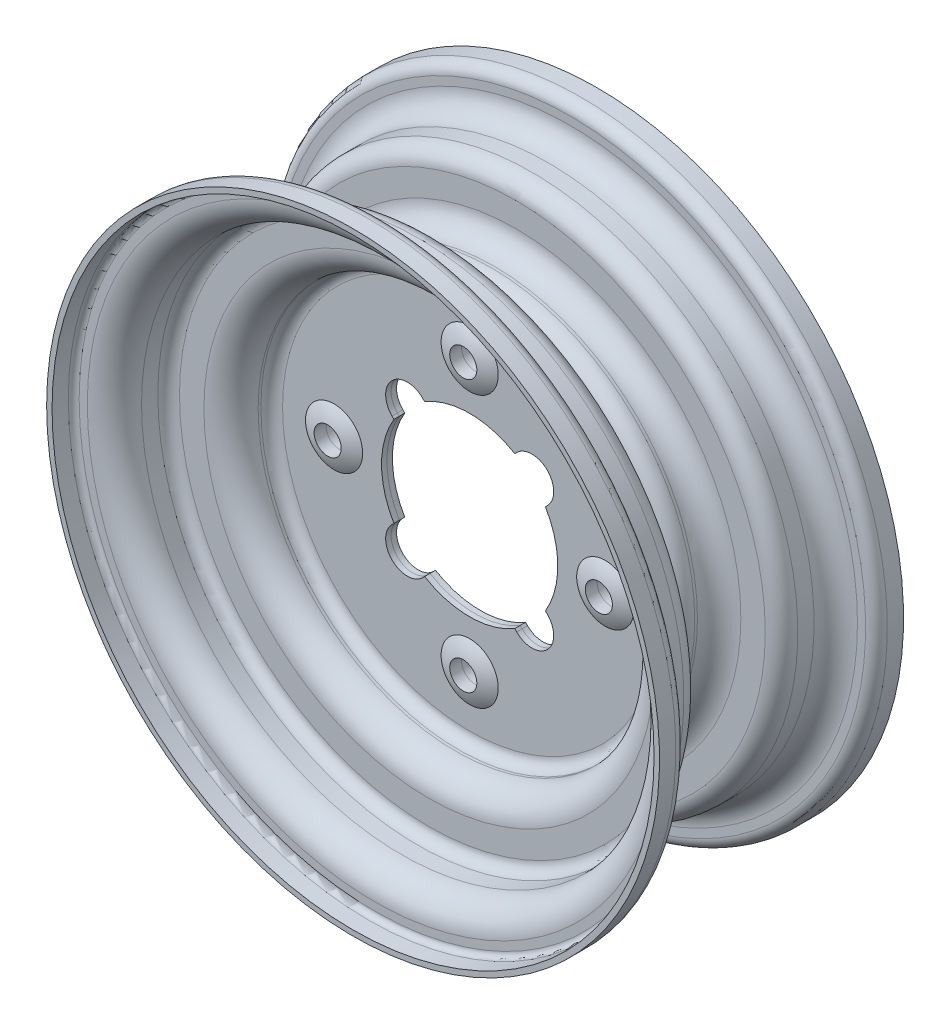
from build123d import *

# Parameters (mm, degrees)
SKETCH2_R          = 32.5
CUT_EXTRUDE1_DEPTH = 166.490181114
SKETCH4_R          = 5
CUT_EXTRUDE2_DEPTH = 166.490181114
CIRPATTERN1_COUNT  = 4


with BuildPart() as part:
    # Sketch1 → Revolve-Thin1 (revolve)
    with BuildSketch(Plane(origin=(0, 0, 0), x_dir=(0, 0, -1), z_dir=(1, 0, 0)), mode=Mode.PRIVATE) as revolve_thin1_sk:
        with BuildLine():
            Line((0, 0), (0, 69))
            ThreePointArc((0, 69), (-1.757359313, 73.242640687), (-6, 75))
            Line((-6, 75), (-7, 75))
            ThreePointArc((-7, 75), (-12.656854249, 77.343145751), (-15, 83))
            Line((-15, 83), (-15, 92))
            ThreePointArc((-15, 92), (-16.757359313, 96.242640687), (-21, 98))
            Line((-21, 98), (-27, 98))
            ThreePointArc((-27, 98), (-32.656854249, 100.343145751), (-35, 106))
            Line((-35, 106), (-35, 109))
            ThreePointArc((-35, 109), (-36.171572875, 111.828427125), (-39, 113))
            Line((-39, 113), (-45, 113))
            Line((-45, 113), (-45, 111))
            Line((-45, 111), (-39, 111))
            ThreePointArc((-39, 111), (-37.585786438, 110.414213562), (-37, 109))
            Line((-37, 109), (-37, 106))
            ThreePointArc((-37, 106), (-34.071067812, 98.928932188), (-27, 96))
            Line((-27, 96), (-21, 96))
            ThreePointArc((-21, 96), (-18.171572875, 94.828427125), (-17, 92))
            Line((-17, 92), (-17, 83))
            ThreePointArc((-17, 83), (-14.071067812, 75.928932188), (-7, 73))
            Line((-7, 73), (-6, 73))
            ThreePointArc((-6, 73), (-3.171572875, 71.828427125), (-2, 69))
            Line((-2, 69), (-2, 0))
            Line((-2, 0), (0, 0))
        make_face()
    revolve(revolve_thin1_sk.sketch.rotate(Axis((0, 0, 0), (0, 0, 1)), 90), axis=Axis((0, 0, 0), (0, 0, 1)))

    # Sketch2 → Cut-Extrude1 (cut, through all)
    with BuildSketch(Plane.XY.offset(2)):
        Circle(SKETCH2_R)
        with BuildLine():
            Line((17.324116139, -28.637824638), (-28.637824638, 17.324116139))
            ThreePointArc((-28.637824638, 17.324116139), (-28.637824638, 28.637824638), (-17.324116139, 28.637824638))
            Line((-17.324116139, 28.637824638), (28.637824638, -17.324116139))
            ThreePointArc((28.637824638, -17.324116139), (28.637824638, -28.637824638), (17.324116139, -28.637824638))
        make_face()
        with BuildLine():
            Line((-28.637824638, -17.324116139), (17.324116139, 28.637824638))
            ThreePointArc((17.324116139, 28.637824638), (28.637824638, 28.637824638), (28.637824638, 17.324116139))
            Line((28.637824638, 17.324116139), (-17.324116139, -28.637824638))
            ThreePointArc((-17.324116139, -28.637824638), (-28.637824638, -28.637824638), (-28.637824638, -17.324116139))
        make_face()
    extrude(amount=-CUT_EXTRUDE1_DEPTH, mode=Mode.SUBTRACT)

    # Sketch3 → Revolve1 (revolve)
    with BuildSketch(Plane(origin=(0, 0, 0), x_dir=(1, 0, 0), z_dir=(0, 1, 0)), mode=Mode.PRIVATE) as revolve1_sk:
        with BuildLine():
            Line((-50, -2), (-39.464346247, -2))
            ThreePointArc((-39.464346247, -2), (-44.522774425, -4.235384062), (-50, -5))
            Line((-50, -5), (-50, -2))
        make_face()
    revolve1 = revolve(revolve1_sk.sketch.rotate(Axis((-50, 0, 5), (0, 0, -1)), 180), axis=Axis((-50, 0, 5), (0, 0, -1)))

    # Sketch4 → Cut-Extrude2 (cut, symmetric)
    with BuildSketch(Plane.XY.offset(2)):
        with Locations((-50, 0)):
            Circle(SKETCH4_R)
    cut_extrude2 = extrude(amount=CUT_EXTRUDE2_DEPTH, both=True, mode=Mode.SUBTRACT)

    # CirPattern1: Revolve1, Cut-Extrude2 ×4 about axis
    cirpattern1_axis = Axis((0, 0, 0), (0, 0, 1))
    add([revolve1.rotate(cirpattern1_axis, i * 360 / CIRPATTERN1_COUNT) for i in range(1, CIRPATTERN1_COUNT)])
    add([cut_extrude2.rotate(cirpattern1_axis, i * 360 / CIRPATTERN1_COUNT) for i in range(1, CIRPATTERN1_COUNT)], mode=Mode.SUBTRACT)


with BuildPart() as body_2:
    # Mirror1: mirrored copy
    add(part.part.mirror(Plane.XY))


solid = Compound([part.part, body_2.part])
